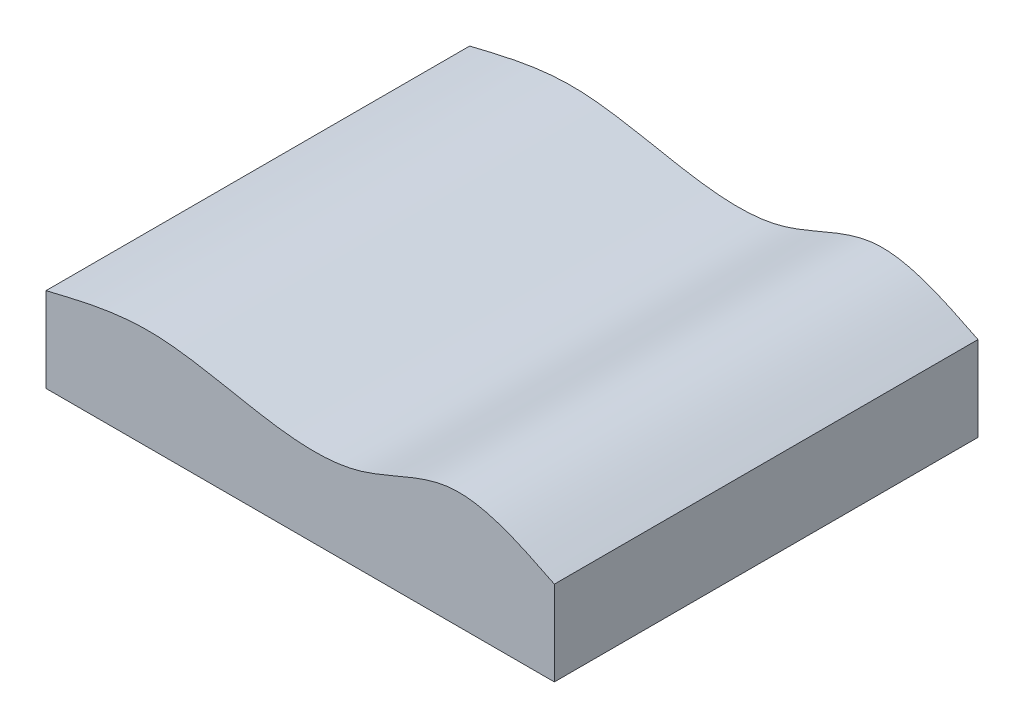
ISO-10303-21;
HEADER;
FILE_DESCRIPTION(('STEP AP214'),'2;1');
FILE_NAME('part.step','',(''),(''),'','','');
FILE_SCHEMA(('AUTOMOTIVE_DESIGN { 1 0 10303 214 1 1 1 1 }'));
ENDSEC;
DATA;
#1=APPLICATION_CONTEXT('core data for automotive mechanical design processes');
#2=APPLICATION_PROTOCOL_DEFINITION('international standard','automotive_design',2000,#1);
#3=PRODUCT_CONTEXT('',#1,'mechanical');
#4=PRODUCT('Part','Part','',(#3));
#5=PRODUCT_RELATED_PRODUCT_CATEGORY('part','',(#4));
#6=PRODUCT_DEFINITION_FORMATION('','',#4);
#7=PRODUCT_DEFINITION_CONTEXT('part definition',#1,'design');
#8=PRODUCT_DEFINITION('design','',#6,#7);
#9=PRODUCT_DEFINITION_SHAPE('','',#8);
#10=(LENGTH_UNIT() NAMED_UNIT(*) SI_UNIT(.MILLI.,.METRE.));
#11=(NAMED_UNIT(*) PLANE_ANGLE_UNIT() SI_UNIT($,.RADIAN.));
#12=(NAMED_UNIT(*) SI_UNIT($,.STERADIAN.) SOLID_ANGLE_UNIT());
#13=UNCERTAINTY_MEASURE_WITH_UNIT(LENGTH_MEASURE(1.E-05),#10,'distance_accuracy_value','');
#14=(GEOMETRIC_REPRESENTATION_CONTEXT(3) GLOBAL_UNCERTAINTY_ASSIGNED_CONTEXT((#13)) GLOBAL_UNIT_ASSIGNED_CONTEXT((#10,
#11,#12)) REPRESENTATION_CONTEXT('',''));
#15=CARTESIAN_POINT('',(0.,0.,0.));
#16=DIRECTION('',(0.,0.,1.));
#17=DIRECTION('',(1.,0.,0.));
#18=AXIS2_PLACEMENT_3D('',#15,#16,#17);
#19=CARTESIAN_POINT('',(0.,0.,127.));
#20=DIRECTION('',(1.,0.,0.));
#21=DIRECTION('',(0.,0.,-1.));
#22=AXIS2_PLACEMENT_3D('',#19,#20,#21);
#23=PLANE('',#22);
#24=DIRECTION('',(0.,-1.,0.));
#25=VECTOR('',#24,1.);
#26=CARTESIAN_POINT('',(0.,0.,0.));
#27=LINE('',#26,#25);
#28=CARTESIAN_POINT('',(0.,25.4,0.));
#29=VERTEX_POINT('',#28);
#30=CARTESIAN_POINT('',(0.,0.,0.));
#31=VERTEX_POINT('',#30);
#32=EDGE_CURVE('E113',#29,#31,#27,.T.);
#33=ORIENTED_EDGE('',*,*,#32,.T.);
#34=DIRECTION('',(0.,0.,-1.));
#35=VECTOR('',#34,1.);
#36=CARTESIAN_POINT('',(0.,0.,127.));
#37=LINE('',#36,#35);
#38=CARTESIAN_POINT('',(0.,0.,127.));
#39=VERTEX_POINT('',#38);
#40=EDGE_CURVE('E11',#39,#31,#37,.T.);
#41=ORIENTED_EDGE('',*,*,#40,.F.);
#42=DIRECTION('',(0.,-1.,0.));
#43=VECTOR('',#42,1.);
#44=CARTESIAN_POINT('',(0.,0.,127.));
#45=LINE('',#44,#43);
#46=CARTESIAN_POINT('',(0.,25.4,127.));
#47=VERTEX_POINT('',#46);
#48=EDGE_CURVE('E97',#47,#39,#45,.T.);
#49=ORIENTED_EDGE('',*,*,#48,.F.);
#50=DIRECTION('',(0.,0.,-1.));
#51=VECTOR('',#50,1.);
#52=CARTESIAN_POINT('',(0.,25.4,127.));
#53=LINE('',#52,#51);
#54=EDGE_CURVE('E106',#47,#29,#53,.T.);
#55=ORIENTED_EDGE('',*,*,#54,.T.);
#56=EDGE_LOOP('',(#33,#41,#49,#55));
#57=FACE_BOUND('',#56,.T.);
#58=ADVANCED_FACE('F44',(#57),#23,.F.);
#59=CARTESIAN_POINT('',(0.,0.,127.));
#60=DIRECTION('',(0.,1.,0.));
#61=DIRECTION('',(0.,0.,1.));
#62=AXIS2_PLACEMENT_3D('',#59,#60,#61);
#63=PLANE('',#62);
#64=DIRECTION('',(1.,0.,0.));
#65=VECTOR('',#64,1.);
#66=CARTESIAN_POINT('',(0.,0.,0.));
#67=LINE('',#66,#65);
#68=CARTESIAN_POINT('',(152.4,0.,0.));
#69=VERTEX_POINT('',#68);
#70=EDGE_CURVE('E101',#31,#69,#67,.T.);
#71=ORIENTED_EDGE('',*,*,#70,.T.);
#72=DIRECTION('',(0.,0.,-1.));
#73=VECTOR('',#72,1.);
#74=CARTESIAN_POINT('',(152.4,0.,127.));
#75=LINE('',#74,#73);
#76=CARTESIAN_POINT('',(152.4,0.,127.));
#77=VERTEX_POINT('',#76);
#78=EDGE_CURVE('E52',#77,#69,#75,.T.);
#79=ORIENTED_EDGE('',*,*,#78,.F.);
#80=DIRECTION('',(1.,0.,0.));
#81=VECTOR('',#80,1.);
#82=CARTESIAN_POINT('',(0.,0.,127.));
#83=LINE('',#82,#81);
#84=EDGE_CURVE('E92',#39,#77,#83,.T.);
#85=ORIENTED_EDGE('',*,*,#84,.F.);
#86=ORIENTED_EDGE('',*,*,#40,.T.);
#87=EDGE_LOOP('',(#71,#79,#85,#86));
#88=FACE_BOUND('',#87,.T.);
#89=ADVANCED_FACE('F100',(#88),#63,.F.);
#90=CARTESIAN_POINT('',(152.4,0.,127.));
#91=DIRECTION('',(-1.,0.,0.));
#92=DIRECTION('',(0.,0.,1.));
#93=AXIS2_PLACEMENT_3D('',#90,#91,#92);
#94=PLANE('',#93);
#95=DIRECTION('',(0.,1.,0.));
#96=VECTOR('',#95,1.);
#97=CARTESIAN_POINT('',(152.4,0.,0.));
#98=LINE('',#97,#96);
#99=CARTESIAN_POINT('',(152.4,25.4,0.));
#100=VERTEX_POINT('',#99);
#101=EDGE_CURVE('E79',#69,#100,#98,.T.);
#102=ORIENTED_EDGE('',*,*,#101,.T.);
#103=DIRECTION('',(0.,0.,-1.));
#104=VECTOR('',#103,1.);
#105=CARTESIAN_POINT('',(152.4,25.4,127.));
#106=LINE('',#105,#104);
#107=CARTESIAN_POINT('',(152.4,25.4,127.));
#108=VERTEX_POINT('',#107);
#109=EDGE_CURVE('E103',#108,#100,#106,.T.);
#110=ORIENTED_EDGE('',*,*,#109,.F.);
#111=DIRECTION('',(0.,1.,0.));
#112=VECTOR('',#111,1.);
#113=CARTESIAN_POINT('',(152.4,0.,127.));
#114=LINE('',#113,#112);
#115=EDGE_CURVE('E95',#77,#108,#114,.T.);
#116=ORIENTED_EDGE('',*,*,#115,.F.);
#117=ORIENTED_EDGE('',*,*,#78,.T.);
#118=EDGE_LOOP('',(#102,#110,#116,#117));
#119=FACE_BOUND('',#118,.T.);
#120=ADVANCED_FACE('F104',(#119),#94,.F.);
#121=CARTESIAN_POINT('',(152.4,25.4,127.));
#122=CARTESIAN_POINT('',(141.906968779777,30.6171690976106,127.));
#123=CARTESIAN_POINT('',(121.976480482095,40.5266724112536,127.));
#124=CARTESIAN_POINT('',(83.1578212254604,15.1733128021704,127.));
#125=CARTESIAN_POINT('',(40.8560652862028,35.3808093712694,127.));
#126=CARTESIAN_POINT('',(10.1408265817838,27.877322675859,127.));
#127=CARTESIAN_POINT('',(0.,25.4,127.));
#128=B_SPLINE_CURVE_WITH_KNOTS('',3,(#121,#122,#123,#124,#125,#126,#127),.UNSPECIFIED.,.F.,.F.,
(4,1,1,1,4),(0.,0.20962993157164,0.398171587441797,0.80130261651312,1.),.UNSPECIFIED.);
#129=DIRECTION('',(0.,0.,-1.));
#130=VECTOR('',#129,1.);
#131=SURFACE_OF_LINEAR_EXTRUSION('',#128,#130);
#132=CARTESIAN_POINT('',(152.4,25.4,0.));
#133=CARTESIAN_POINT('',(141.906968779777,30.6171690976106,0.));
#134=CARTESIAN_POINT('',(121.976480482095,40.5266724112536,0.));
#135=CARTESIAN_POINT('',(83.1578212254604,15.1733128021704,0.));
#136=CARTESIAN_POINT('',(40.8560652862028,35.3808093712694,0.));
#137=CARTESIAN_POINT('',(10.1408265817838,27.877322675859,0.));
#138=CARTESIAN_POINT('',(0.,25.4,0.));
#139=B_SPLINE_CURVE_WITH_KNOTS('',3,(#132,#133,#134,#135,#136,#137,#138),.UNSPECIFIED.,.F.,.F.,
(4,1,1,1,4),(0.,0.20962993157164,0.398171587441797,0.80130261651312,1.),.UNSPECIFIED.);
#140=EDGE_CURVE('E85',#100,#29,#139,.T.);
#141=ORIENTED_EDGE('',*,*,#140,.T.);
#142=ORIENTED_EDGE('',*,*,#54,.F.);
#143=EDGE_CURVE('E60',#108,#47,#128,.T.);
#144=ORIENTED_EDGE('',*,*,#143,.F.);
#145=ORIENTED_EDGE('',*,*,#109,.T.);
#146=EDGE_LOOP('',(#141,#142,#144,#145));
#147=FACE_BOUND('',#146,.T.);
#148=ADVANCED_FACE('F119',(#147),#131,.F.);
#149=CARTESIAN_POINT('',(77.7215339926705,23.8921648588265,127.));
#150=DIRECTION('',(0.,0.,-1.));
#151=DIRECTION('',(-1.,0.,0.));
#152=AXIS2_PLACEMENT_3D('',#149,#150,#151);
#153=PLANE('',#152);
#154=ORIENTED_EDGE('',*,*,#48,.T.);
#155=ORIENTED_EDGE('',*,*,#84,.T.);
#156=ORIENTED_EDGE('',*,*,#115,.T.);
#157=ORIENTED_EDGE('',*,*,#143,.T.);
#158=EDGE_LOOP('',(#154,#155,#156,#157));
#159=FACE_BOUND('',#158,.T.);
#160=ADVANCED_FACE('F93',(#159),#153,.F.);
#161=CARTESIAN_POINT('',(77.7215339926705,23.8921648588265,0.));
#162=DIRECTION('',(0.,0.,-1.));
#163=DIRECTION('',(-1.,0.,0.));
#164=AXIS2_PLACEMENT_3D('',#161,#162,#163);
#165=PLANE('',#164);
#166=ORIENTED_EDGE('',*,*,#32,.F.);
#167=ORIENTED_EDGE('',*,*,#140,.F.);
#168=ORIENTED_EDGE('',*,*,#101,.F.);
#169=ORIENTED_EDGE('',*,*,#70,.F.);
#170=EDGE_LOOP('',(#166,#167,#168,#169));
#171=FACE_BOUND('',#170,.T.);
#172=ADVANCED_FACE('F123',(#171),#165,.T.);
#173=CLOSED_SHELL('',(#58,#89,#120,#148,#160,#172));
#174=MANIFOLD_SOLID_BREP('B2',#173);
#175=ADVANCED_BREP_SHAPE_REPRESENTATION('',(#18,#174),#14);
#176=SHAPE_DEFINITION_REPRESENTATION(#9,#175);
ENDSEC;
END-ISO-10303-21;
